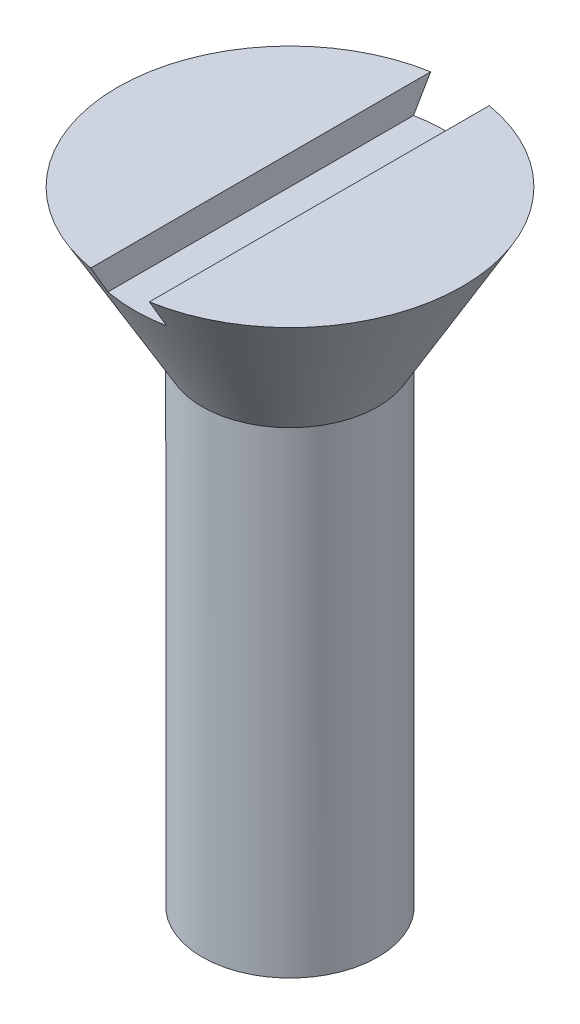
ISO-10303-21;
HEADER;
FILE_DESCRIPTION(('STEP AP214'),'2;1');
FILE_NAME('part.step','',(''),(''),'','','');
FILE_SCHEMA(('AUTOMOTIVE_DESIGN { 1 0 10303 214 1 1 1 1 }'));
ENDSEC;
DATA;
#1=APPLICATION_CONTEXT('core data for automotive mechanical design processes');
#2=APPLICATION_PROTOCOL_DEFINITION('international standard','automotive_design',2000,#1);
#3=PRODUCT_CONTEXT('',#1,'mechanical');
#4=PRODUCT('Part','Part','',(#3));
#5=PRODUCT_RELATED_PRODUCT_CATEGORY('part','',(#4));
#6=PRODUCT_DEFINITION_FORMATION('','',#4);
#7=PRODUCT_DEFINITION_CONTEXT('part definition',#1,'design');
#8=PRODUCT_DEFINITION('design','',#6,#7);
#9=PRODUCT_DEFINITION_SHAPE('','',#8);
#10=(LENGTH_UNIT() NAMED_UNIT(*) SI_UNIT(.MILLI.,.METRE.));
#11=(NAMED_UNIT(*) PLANE_ANGLE_UNIT() SI_UNIT($,.RADIAN.));
#12=(NAMED_UNIT(*) SI_UNIT($,.STERADIAN.) SOLID_ANGLE_UNIT());
#13=UNCERTAINTY_MEASURE_WITH_UNIT(LENGTH_MEASURE(1.E-05),#10,'distance_accuracy_value','');
#14=(GEOMETRIC_REPRESENTATION_CONTEXT(3) GLOBAL_UNCERTAINTY_ASSIGNED_CONTEXT((#13)) GLOBAL_UNIT_ASSIGNED_CONTEXT((#10,
#11,#12)) REPRESENTATION_CONTEXT('',''));
#15=CARTESIAN_POINT('',(0.,0.,0.));
#16=DIRECTION('',(0.,0.,1.));
#17=DIRECTION('',(1.,0.,0.));
#18=AXIS2_PLACEMENT_3D('',#15,#16,#17);
#19=CARTESIAN_POINT('',(0.,23.,0.));
#20=DIRECTION('',(0.,-1.,0.));
#21=DIRECTION('',(0.,0.,-1.));
#22=AXIS2_PLACEMENT_3D('',#19,#20,#21);
#23=PLANE('',#22);
#24=CARTESIAN_POINT('',(0.,23.,0.));
#25=DIRECTION('',(0.,-1.,0.));
#26=DIRECTION('',(0.,0.,-1.));
#27=AXIS2_PLACEMENT_3D('',#24,#25,#26);
#28=CIRCLE('',#27,5.88675134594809);
#29=CARTESIAN_POINT('',(-1.,23.,5.80119310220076));
#30=VERTEX_POINT('',#29);
#31=CARTESIAN_POINT('',(-1.,23.,-5.80119310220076));
#32=VERTEX_POINT('',#31);
#33=EDGE_CURVE('E83',#30,#32,#28,.T.);
#34=ORIENTED_EDGE('',*,*,#33,.F.);
#35=DIRECTION('',(0.,0.,1.));
#36=VECTOR('',#35,1.);
#37=CARTESIAN_POINT('',(-1.,23.,-6.99566691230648));
#38=LINE('',#37,#36);
#39=EDGE_CURVE('E76',#32,#30,#38,.T.);
#40=ORIENTED_EDGE('',*,*,#39,.F.);
#41=EDGE_LOOP('',(#34,#40));
#42=FACE_BOUND('',#41,.T.);
#43=ADVANCED_FACE('F30',(#42),#23,.F.);
#44=CARTESIAN_POINT('',(0.,1.73205080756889,0.));
#45=DIRECTION('',(0.,1.,0.));
#46=DIRECTION('',(0.,0.,1.));
#47=AXIS2_PLACEMENT_3D('',#44,#45,#46);
#48=CONICAL_SURFACE('',#47,3.,1.04719755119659);
#49=CARTESIAN_POINT('',(0.,0.,0.));
#50=VERTEX_POINT('',#49);
#51=VERTEX_LOOP('',#50);
#52=FACE_BOUND('',#51,.T.);
#53=CARTESIAN_POINT('',(0.,1.73205080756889,0.));
#54=DIRECTION('',(0.,-1.,0.));
#55=DIRECTION('',(0.,0.,-1.));
#56=AXIS2_PLACEMENT_3D('',#53,#54,#55);
#57=CIRCLE('',#56,3.);
#58=CARTESIAN_POINT('',(0.,1.73205080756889,-3.));
#59=VERTEX_POINT('',#58);
#60=EDGE_CURVE('E96',#59,#59,#57,.T.);
#61=ORIENTED_EDGE('',*,*,#60,.T.);
#62=EDGE_LOOP('',(#61));
#63=FACE_BOUND('',#62,.T.);
#64=ADVANCED_FACE('F32',(#52,#63),#48,.T.);
#65=CARTESIAN_POINT('',(1.,23.,-5.80119310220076));
#66=VERTEX_POINT('',#65);
#67=CARTESIAN_POINT('',(1.,23.,5.80119310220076));
#68=VERTEX_POINT('',#67);
#69=EDGE_CURVE('E90',#66,#68,#28,.T.);
#70=ORIENTED_EDGE('',*,*,#69,.F.);
#71=DIRECTION('',(0.,0.,-1.));
#72=VECTOR('',#71,1.);
#73=CARTESIAN_POINT('',(1.,23.,-6.99566691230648));
#74=LINE('',#73,#72);
#75=EDGE_CURVE('E84',#68,#66,#74,.T.);
#76=ORIENTED_EDGE('',*,*,#75,.F.);
#77=EDGE_LOOP('',(#70,#76));
#78=FACE_BOUND('',#77,.T.);
#79=ADVANCED_FACE('F136',(#78),#23,.F.);
#80=CARTESIAN_POINT('',(0.,23.,0.));
#81=DIRECTION('',(0.,1.,0.));
#82=DIRECTION('',(0.,0.,1.));
#83=AXIS2_PLACEMENT_3D('',#80,#81,#82);
#84=CONICAL_SURFACE('',#83,5.88675134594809,0.523598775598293);
#85=ORIENTED_EDGE('',*,*,#33,.T.);
#86=CARTESIAN_POINT('',(-1.,28.1474759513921,-8.80202498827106));
#87=CARTESIAN_POINT('',(-1.,27.6362638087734,-8.50496320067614));
#88=CARTESIAN_POINT('',(-1.,27.1251228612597,-8.20777858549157));
#89=CARTESIAN_POINT('',(-1.,26.1030859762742,-7.6130176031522));
#90=CARTESIAN_POINT('',(-1.,25.5921900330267,-7.3154412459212));
#91=CARTESIAN_POINT('',(-1.,24.5707733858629,-6.71976685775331));
#92=CARTESIAN_POINT('',(-1.,24.0602526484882,-6.42166888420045));
#93=CARTESIAN_POINT('',(-1.,23.0396806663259,-5.82464078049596));
#94=CARTESIAN_POINT('',(-1.,22.5296294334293,-5.52571062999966));
#95=CARTESIAN_POINT('',(-1.,21.7650882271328,-5.07629034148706));
#96=CARTESIAN_POINT('',(-1.,21.5103056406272,-4.92629807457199));
#97=CARTESIAN_POINT('',(-1.,21.0010004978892,-4.62587557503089));
#98=CARTESIAN_POINT('',(-1.,20.7464779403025,-4.47544534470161));
#99=CARTESIAN_POINT('',(-1.,20.2377961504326,-4.17400896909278));
#100=CARTESIAN_POINT('',(-1.,19.9836368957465,-4.02300286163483));
#101=CARTESIAN_POINT('',(-1.,19.4757950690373,-3.72017935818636));
#102=CARTESIAN_POINT('',(-1.,19.2221125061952,-3.56836194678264));
#103=CARTESIAN_POINT('',(-1.,18.7153916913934,-3.26352873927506));
#104=CARTESIAN_POINT('',(-1.,18.4623535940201,-3.11051268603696));
#105=CARTESIAN_POINT('',(-1.,17.9573535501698,-2.80273806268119));
#106=CARTESIAN_POINT('',(-1.,17.7053915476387,-2.64797958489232));
#107=CARTESIAN_POINT('',(-1.,17.3287578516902,-2.41366290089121));
#108=CARTESIAN_POINT('',(-1.,17.2034154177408,-2.33518391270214));
#109=CARTESIAN_POINT('',(-1.,16.953343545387,-2.17726154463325));
#110=CARTESIAN_POINT('',(-1.,16.828614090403,-2.09781819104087));
#111=CARTESIAN_POINT('',(-1.,16.5799738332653,-1.93760528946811));
#112=CARTESIAN_POINT('',(-1.,16.4560631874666,-1.85683549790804));
#113=CARTESIAN_POINT('',(-1.,16.2711177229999,-1.73427826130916));
#114=CARTESIAN_POINT('',(-1.,16.2096198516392,-1.69319017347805));
#115=CARTESIAN_POINT('',(-1.,16.0870111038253,-1.61043723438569));
#116=CARTESIAN_POINT('',(-1.,16.0259002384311,-1.56877236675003));
#117=CARTESIAN_POINT('',(-1.,15.9650237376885,-1.52676506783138));
#118=B_SPLINE_CURVE_WITH_KNOTS('',3,(#86,#87,#88,#89,#90,#91,#92,#93,#94,#95,#96,#97,#98,#99,
#100,#101,#102,#103,#104,#105,#106,#107,#108,#109,#110,#111,#112,#113,#114,#115,#116,#117),
.UNSPECIFIED.,.F.,.F.,(4,2,2,2,2,2,2,2,2,2,2,2,2,2,2,4),(0.,1.773767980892,3.5474918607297,
5.32103154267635,7.09461497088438,7.98157949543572,8.86853937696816,9.75544197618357,
10.6423614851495,11.5294767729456,12.4165452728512,12.8601940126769,13.3038306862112,
13.7475497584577,13.9694296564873,14.1913158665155),.UNSPECIFIED.);
#119=CARTESIAN_POINT('',(-1.,22.,-5.21437817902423));
#120=VERTEX_POINT('',#119);
#121=EDGE_CURVE('E11',#32,#120,#118,.T.);
#122=ORIENTED_EDGE('',*,*,#121,.T.);
#123=CARTESIAN_POINT('',(0.,22.,0.));
#124=DIRECTION('',(0.,1.,0.));
#125=DIRECTION('',(0.,0.,1.));
#126=AXIS2_PLACEMENT_3D('',#123,#124,#125);
#127=CIRCLE('',#126,5.30940107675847);
#128=CARTESIAN_POINT('',(1.,22.,-5.21437817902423));
#129=VERTEX_POINT('',#128);
#130=EDGE_CURVE('E102',#129,#120,#127,.T.);
#131=ORIENTED_EDGE('',*,*,#130,.F.);
#132=CARTESIAN_POINT('',(1.,15.9650237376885,-1.52676506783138));
#133=CARTESIAN_POINT('',(1.,16.048570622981,-1.5843985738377));
#134=CARTESIAN_POINT('',(1.,16.1325452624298,-1.64140459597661));
#135=CARTESIAN_POINT('',(1.,16.3011682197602,-1.75440292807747));
#136=CARTESIAN_POINT('',(1.,16.3858165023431,-1.81039529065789));
#137=CARTESIAN_POINT('',(1.,16.5556017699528,-1.92160572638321));
#138=CARTESIAN_POINT('',(1.,16.6407386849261,-1.97682390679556));
#139=CARTESIAN_POINT('',(1.,16.8114078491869,-2.08664823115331));
#140=CARTESIAN_POINT('',(1.,16.8969401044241,-2.14125436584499));
#141=CARTESIAN_POINT('',(1.,17.1539592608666,-2.30431487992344));
#142=CARTESIAN_POINT('',(1.,17.3259097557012,-2.41203817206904));
#143=CARTESIAN_POINT('',(1.,17.6706372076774,-2.62616714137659));
#144=CARTESIAN_POINT('',(1.,17.8434142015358,-2.73257275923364));
#145=CARTESIAN_POINT('',(1.,18.3477482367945,-3.04130678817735));
#146=CARTESIAN_POINT('',(1.,18.6800618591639,-3.24239823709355));
#147=CARTESIAN_POINT('',(1.,19.3458384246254,-3.6426536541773));
#148=CARTESIAN_POINT('',(1.,19.6793013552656,-3.84181764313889));
#149=CARTESIAN_POINT('',(1.,20.3470278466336,-4.23896218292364));
#150=CARTESIAN_POINT('',(1.,20.6812915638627,-4.43694247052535));
#151=CARTESIAN_POINT('',(1.,21.3503035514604,-4.83208282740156));
#152=CARTESIAN_POINT('',(1.,21.685051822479,-5.02924289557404));
#153=CARTESIAN_POINT('',(1.,22.5297548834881,-5.52578382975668));
#154=CARTESIAN_POINT('',(1.,23.0399313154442,-5.82478754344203));
#155=CARTESIAN_POINT('',(1.,24.0607667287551,-6.42196948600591));
#156=CARTESIAN_POINT('',(1.,24.5714257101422,-6.72014771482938));
#157=CARTESIAN_POINT('',(1.,25.5928557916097,-7.31582907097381));
#158=CARTESIAN_POINT('',(1.,26.1036267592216,-7.61333242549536));
#159=CARTESIAN_POINT('',(1.,27.1254000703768,-8.20793978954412));
#160=CARTESIAN_POINT('',(1.,27.6364024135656,-8.50504379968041));
#161=CARTESIAN_POINT('',(1.,28.1474759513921,-8.80202498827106));
#162=B_SPLINE_CURVE_WITH_KNOTS('',3,(#132,#133,#134,#135,#136,#137,#138,#139,#140,#141,#142,
#143,#144,#145,#146,#147,#148,#149,#150,#151,#152,#153,#154,#155,#156,#157,#158,#159,#160,#161),
.UNSPECIFIED.,.F.,.F.,(4,2,2,2,2,2,2,2,2,2,2,2,2,2,4),(0.,0.304483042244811,0.608950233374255,
0.913374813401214,1.21780398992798,1.82651489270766,2.43525309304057,3.60049880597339,
4.76573193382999,5.93121519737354,7.09670002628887,8.8707191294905,10.6447383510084,
12.4180280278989,14.1913149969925),.UNSPECIFIED.);
#163=EDGE_CURVE('E43',#129,#66,#162,.T.);
#164=ORIENTED_EDGE('',*,*,#163,.T.);
#165=ORIENTED_EDGE('',*,*,#69,.T.);
#166=CARTESIAN_POINT('',(1.,28.1474759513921,8.80202498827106));
#167=CARTESIAN_POINT('',(1.,27.6362638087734,8.50496320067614));
#168=CARTESIAN_POINT('',(1.,27.1251228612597,8.20777858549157));
#169=CARTESIAN_POINT('',(1.,26.1030859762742,7.6130176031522));
#170=CARTESIAN_POINT('',(1.,25.5921900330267,7.3154412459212));
#171=CARTESIAN_POINT('',(1.,24.5707733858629,6.71976685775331));
#172=CARTESIAN_POINT('',(1.,24.0602526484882,6.42166888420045));
#173=CARTESIAN_POINT('',(1.,23.0396806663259,5.82464078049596));
#174=CARTESIAN_POINT('',(1.,22.5296294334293,5.52571062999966));
#175=CARTESIAN_POINT('',(1.,21.7650882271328,5.07629034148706));
#176=CARTESIAN_POINT('',(1.,21.5103056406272,4.92629807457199));
#177=CARTESIAN_POINT('',(1.,21.0010004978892,4.62587557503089));
#178=CARTESIAN_POINT('',(1.,20.7464779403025,4.47544534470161));
#179=CARTESIAN_POINT('',(1.,20.2377961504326,4.17400896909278));
#180=CARTESIAN_POINT('',(1.,19.9836368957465,4.02300286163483));
#181=CARTESIAN_POINT('',(1.,19.4757950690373,3.72017935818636));
#182=CARTESIAN_POINT('',(1.,19.2221125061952,3.56836194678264));
#183=CARTESIAN_POINT('',(1.,18.7153916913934,3.26352873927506));
#184=CARTESIAN_POINT('',(1.,18.4623535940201,3.11051268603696));
#185=CARTESIAN_POINT('',(1.,17.9573535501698,2.80273806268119));
#186=CARTESIAN_POINT('',(1.,17.7053915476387,2.64797958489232));
#187=CARTESIAN_POINT('',(1.,17.3287578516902,2.41366290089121));
#188=CARTESIAN_POINT('',(1.,17.2034154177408,2.33518391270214));
#189=CARTESIAN_POINT('',(1.,16.953343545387,2.17726154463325));
#190=CARTESIAN_POINT('',(1.,16.828614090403,2.09781819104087));
#191=CARTESIAN_POINT('',(1.,16.5799738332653,1.93760528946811));
#192=CARTESIAN_POINT('',(1.,16.4560631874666,1.85683549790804));
#193=CARTESIAN_POINT('',(1.,16.2711177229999,1.73427826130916));
#194=CARTESIAN_POINT('',(1.,16.2096198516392,1.69319017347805));
#195=CARTESIAN_POINT('',(1.,16.0870111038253,1.61043723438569));
#196=CARTESIAN_POINT('',(1.,16.0259002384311,1.56877236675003));
#197=CARTESIAN_POINT('',(1.,15.9650237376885,1.52676506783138));
#198=B_SPLINE_CURVE_WITH_KNOTS('',3,(#166,#167,#168,#169,#170,#171,#172,#173,#174,#175,#176,
#177,#178,#179,#180,#181,#182,#183,#184,#185,#186,#187,#188,#189,#190,#191,#192,#193,#194,#195,
#196,#197),.UNSPECIFIED.,.F.,.F.,(4,2,2,2,2,2,2,2,2,2,2,2,2,2,2,4),(0.,1.773767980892,
3.5474918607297,5.32103154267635,7.09461497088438,7.98157949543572,8.86853937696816,
9.75544197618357,10.6423614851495,11.5294767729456,12.4165452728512,12.8601940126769,
13.3038306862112,13.7475497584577,13.9694296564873,14.1913158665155),.UNSPECIFIED.);
#199=CARTESIAN_POINT('',(1.,22.,5.21437817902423));
#200=VERTEX_POINT('',#199);
#201=EDGE_CURVE('E101',#68,#200,#198,.T.);
#202=ORIENTED_EDGE('',*,*,#201,.T.);
#203=CARTESIAN_POINT('',(-1.,22.,5.21437817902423));
#204=VERTEX_POINT('',#203);
#205=EDGE_CURVE('E94',#204,#200,#127,.T.);
#206=ORIENTED_EDGE('',*,*,#205,.F.);
#207=CARTESIAN_POINT('',(-1.,15.9650237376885,1.52676506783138));
#208=CARTESIAN_POINT('',(-1.,16.048570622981,1.5843985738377));
#209=CARTESIAN_POINT('',(-1.,16.1325452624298,1.64140459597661));
#210=CARTESIAN_POINT('',(-1.,16.3011682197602,1.75440292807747));
#211=CARTESIAN_POINT('',(-1.,16.3858165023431,1.81039529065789));
#212=CARTESIAN_POINT('',(-1.,16.5556017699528,1.92160572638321));
#213=CARTESIAN_POINT('',(-1.,16.6407386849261,1.97682390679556));
#214=CARTESIAN_POINT('',(-1.,16.8114078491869,2.08664823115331));
#215=CARTESIAN_POINT('',(-1.,16.8969401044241,2.14125436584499));
#216=CARTESIAN_POINT('',(-1.,17.1539592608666,2.30431487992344));
#217=CARTESIAN_POINT('',(-1.,17.3259097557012,2.41203817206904));
#218=CARTESIAN_POINT('',(-1.,17.6706372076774,2.62616714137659));
#219=CARTESIAN_POINT('',(-1.,17.8434142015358,2.73257275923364));
#220=CARTESIAN_POINT('',(-1.,18.3477482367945,3.04130678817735));
#221=CARTESIAN_POINT('',(-1.,18.6800618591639,3.24239823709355));
#222=CARTESIAN_POINT('',(-1.,19.3458384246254,3.6426536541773));
#223=CARTESIAN_POINT('',(-1.,19.6793013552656,3.84181764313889));
#224=CARTESIAN_POINT('',(-1.,20.3470278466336,4.23896218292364));
#225=CARTESIAN_POINT('',(-1.,20.6812915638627,4.43694247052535));
#226=CARTESIAN_POINT('',(-1.,21.3503035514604,4.83208282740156));
#227=CARTESIAN_POINT('',(-1.,21.685051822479,5.02924289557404));
#228=CARTESIAN_POINT('',(-1.,22.5297548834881,5.52578382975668));
#229=CARTESIAN_POINT('',(-1.,23.0399313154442,5.82478754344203));
#230=CARTESIAN_POINT('',(-1.,24.0607667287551,6.42196948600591));
#231=CARTESIAN_POINT('',(-1.,24.5714257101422,6.72014771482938));
#232=CARTESIAN_POINT('',(-1.,25.5928557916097,7.31582907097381));
#233=CARTESIAN_POINT('',(-1.,26.1036267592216,7.61333242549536));
#234=CARTESIAN_POINT('',(-1.,27.1254000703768,8.20793978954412));
#235=CARTESIAN_POINT('',(-1.,27.6364024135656,8.50504379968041));
#236=CARTESIAN_POINT('',(-1.,28.1474759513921,8.80202498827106));
#237=B_SPLINE_CURVE_WITH_KNOTS('',3,(#207,#208,#209,#210,#211,#212,#213,#214,#215,#216,#217,
#218,#219,#220,#221,#222,#223,#224,#225,#226,#227,#228,#229,#230,#231,#232,#233,#234,#235,#236),
.UNSPECIFIED.,.F.,.F.,(4,2,2,2,2,2,2,2,2,2,2,2,2,2,4),(0.,0.304483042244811,0.608950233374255,
0.913374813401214,1.21780398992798,1.82651489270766,2.43525309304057,3.60049880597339,
4.76573193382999,5.93121519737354,7.09670002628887,8.8707191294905,10.6447383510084,
12.4180280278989,14.1913149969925),.UNSPECIFIED.);
#238=EDGE_CURVE('E89',#204,#30,#237,.T.);
#239=ORIENTED_EDGE('',*,*,#238,.T.);
#240=EDGE_LOOP('',(#85,#122,#131,#164,#165,#202,#206,#239));
#241=FACE_BOUND('',#240,.T.);
#242=CARTESIAN_POINT('',(0.,18.,0.));
#243=DIRECTION('',(0.,-1.,0.));
#244=DIRECTION('',(0.,0.,-1.));
#245=AXIS2_PLACEMENT_3D('',#242,#243,#244);
#246=CIRCLE('',#245,3.);
#247=CARTESIAN_POINT('',(0.,18.,-3.));
#248=VERTEX_POINT('',#247);
#249=EDGE_CURVE('E91',#248,#248,#246,.T.);
#250=ORIENTED_EDGE('',*,*,#249,.F.);
#251=EDGE_LOOP('',(#250));
#252=FACE_BOUND('',#251,.T.);
#253=ADVANCED_FACE('F86',(#241,#252),#84,.T.);
#254=CARTESIAN_POINT('',(0.,0.,0.));
#255=DIRECTION('',(0.,-1.,0.));
#256=DIRECTION('',(0.,0.,-1.));
#257=AXIS2_PLACEMENT_3D('',#254,#255,#256);
#258=CYLINDRICAL_SURFACE('',#257,3.);
#259=ORIENTED_EDGE('',*,*,#60,.F.);
#260=EDGE_LOOP('',(#259));
#261=FACE_BOUND('',#260,.T.);
#262=ORIENTED_EDGE('',*,*,#249,.T.);
#263=EDGE_LOOP('',(#262));
#264=FACE_BOUND('',#263,.T.);
#265=ADVANCED_FACE('F142',(#261,#264),#258,.T.);
#266=CARTESIAN_POINT('',(-1.,22.,-6.99566691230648));
#267=DIRECTION('',(-1.,0.,0.));
#268=DIRECTION('',(0.,0.,1.));
#269=AXIS2_PLACEMENT_3D('',#266,#267,#268);
#270=PLANE('',#269);
#271=ORIENTED_EDGE('',*,*,#39,.T.);
#272=ORIENTED_EDGE('',*,*,#238,.F.);
#273=DIRECTION('',(0.,0.,1.));
#274=VECTOR('',#273,1.);
#275=CARTESIAN_POINT('',(-1.,22.,-6.99566691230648));
#276=LINE('',#275,#274);
#277=EDGE_CURVE('E50',#120,#204,#276,.T.);
#278=ORIENTED_EDGE('',*,*,#277,.F.);
#279=ORIENTED_EDGE('',*,*,#121,.F.);
#280=EDGE_LOOP('',(#271,#272,#278,#279));
#281=FACE_BOUND('',#280,.T.);
#282=ADVANCED_FACE('F75',(#281),#270,.F.);
#283=CARTESIAN_POINT('',(1.,22.,-6.99566691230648));
#284=DIRECTION('',(1.,0.,0.));
#285=DIRECTION('',(0.,0.,-1.));
#286=AXIS2_PLACEMENT_3D('',#283,#284,#285);
#287=PLANE('',#286);
#288=DIRECTION('',(0.,0.,-1.));
#289=VECTOR('',#288,1.);
#290=CARTESIAN_POINT('',(1.,22.,-6.99566691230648));
#291=LINE('',#290,#289);
#292=EDGE_CURVE('E129',#200,#129,#291,.T.);
#293=ORIENTED_EDGE('',*,*,#292,.F.);
#294=ORIENTED_EDGE('',*,*,#201,.F.);
#295=ORIENTED_EDGE('',*,*,#75,.T.);
#296=ORIENTED_EDGE('',*,*,#163,.F.);
#297=EDGE_LOOP('',(#293,#294,#295,#296));
#298=FACE_BOUND('',#297,.T.);
#299=ADVANCED_FACE('F114',(#298),#287,.F.);
#300=CARTESIAN_POINT('',(-1.,22.,6.99566691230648));
#301=DIRECTION('',(0.,1.,0.));
#302=DIRECTION('',(0.,0.,1.));
#303=AXIS2_PLACEMENT_3D('',#300,#301,#302);
#304=PLANE('',#303);
#305=ORIENTED_EDGE('',*,*,#130,.T.);
#306=ORIENTED_EDGE('',*,*,#277,.T.);
#307=ORIENTED_EDGE('',*,*,#205,.T.);
#308=ORIENTED_EDGE('',*,*,#292,.T.);
#309=EDGE_LOOP('',(#305,#306,#307,#308));
#310=FACE_BOUND('',#309,.T.);
#311=ADVANCED_FACE('F118',(#310),#304,.T.);
#312=CLOSED_SHELL('',(#43,#64,#79,#253,#265,#282,#299,#311));
#313=MANIFOLD_SOLID_BREP('B2',#312);
#314=ADVANCED_BREP_SHAPE_REPRESENTATION('',(#18,#313),#14);
#315=SHAPE_DEFINITION_REPRESENTATION(#9,#314);
ENDSEC;
END-ISO-10303-21;
